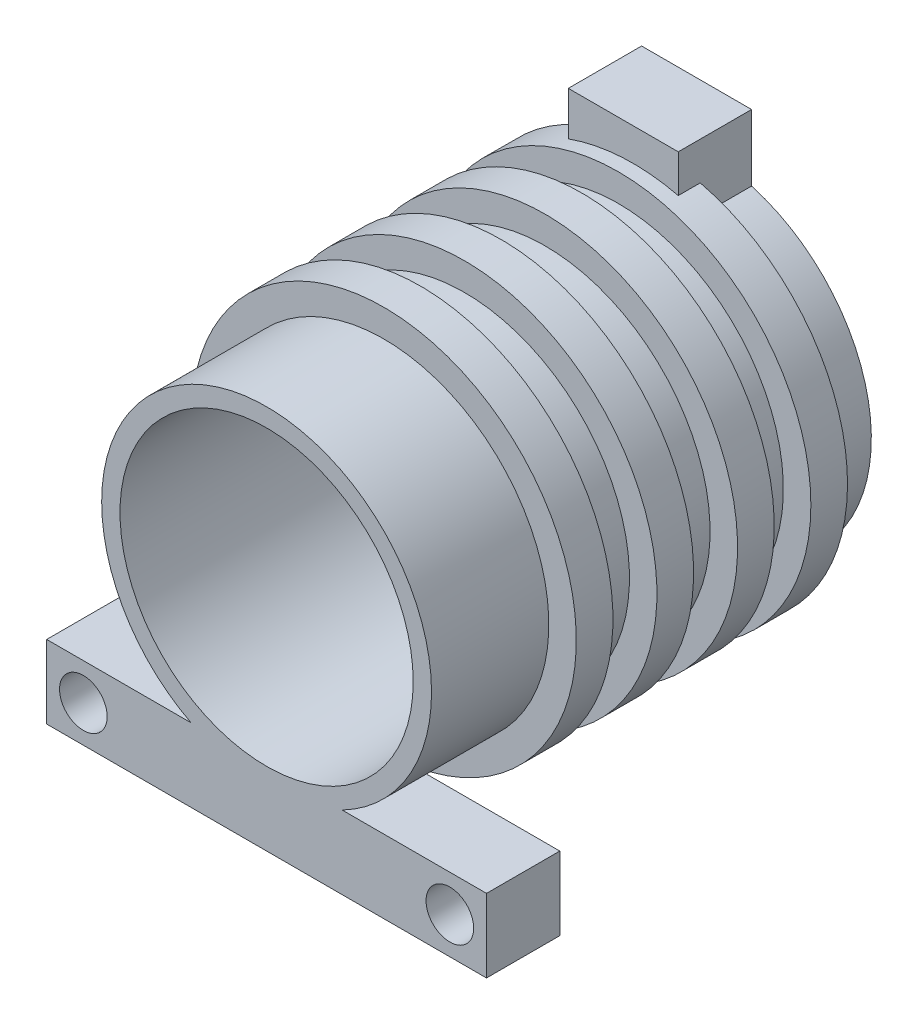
from build123d import *

# Parameters (mm, degrees)
SKETCH2_R           = 57.15
BOSS_EXTRUDE1_DEPTH = 152.4
SKETCH3_R           = 50.8
CUT_EXTRUDE1_DEPTH  = 152.4
SKETCH34_W          = 152.4
SKETCH34_H          = 25.4
BOSS_EXTRUDE3_DEPTH = 25.4
SKETCH35_R          = 8.255
CUT_EXTRUDE2_DEPTH  = 30.48
BOSS_EXTRUDE4_START = -99.06
SKETCH37_R          = 66.675
SKETCH37_R_2        = 57.15
BOSS_EXTRUDE4_DEPTH = 12.7
BOSS_EXTRUDE5_START = -71.12
SKETCH38_R          = 66.675
SKETCH38_R_2        = 57.15
BOSS_EXTRUDE5_DEPTH = 12.7
BOSS_EXTRUDE6_START = -43.18
SKETCH39_R          = 66.675
SKETCH39_R_2        = 57.15
BOSS_EXTRUDE6_DEPTH = 12.7
BOSS_EXTRUDE7_START = -17.78
SKETCH40_R          = 66.675
SKETCH40_R_2        = 57.15
BOSS_EXTRUDE7_DEPTH = 12.7
BOSS_EXTRUDE2_DEPTH = 25.4


with BuildPart() as part:
    # Sketch2 → Boss-Extrude1 (new body)
    with BuildSketch(Plane.XY):
        with Locations(Location((0, 0, 0), (0, 0, 180))):
            Circle(SKETCH2_R)
    extrude(amount=BOSS_EXTRUDE1_DEPTH)

    # Sketch3 → Cut-Extrude1 (cut)
    with BuildSketch(Plane.XY.offset(152.4)):
        Circle(SKETCH3_R)
    extrude(amount=-CUT_EXTRUDE1_DEPTH, mode=Mode.SUBTRACT)

    # Sketch34 → Boss-Extrude3 (add)
    with BuildSketch(Plane.XY.offset(152.4)):
        with Locations((0, -63.5)):
            Rectangle(SKETCH34_W, SKETCH34_H)
    extrude(amount=-BOSS_EXTRUDE3_DEPTH)

    # Sketch35 → Cut-Extrude2 (cut)
    with BuildSketch(Plane.XY.offset(152.4)):
        with Locations((-63.5, -63.5)):
            Circle(SKETCH35_R)
        with Locations((63.5, -63.5)):
            Circle(SKETCH35_R)
    extrude(amount=-CUT_EXTRUDE2_DEPTH, mode=Mode.SUBTRACT)

    # Sketch37 → Boss-Extrude4 (add)
    with BuildSketch(Plane(origin=(0, 0, 0), x_dir=(-1, 0, 0), z_dir=(0, 0, -1)).offset(BOSS_EXTRUDE4_START)):
        Circle(SKETCH37_R)
        Circle(SKETCH37_R_2, mode=Mode.SUBTRACT)
    extrude(amount=-BOSS_EXTRUDE4_DEPTH)

    # Sketch38 → Boss-Extrude5 (add)
    with BuildSketch(Plane(origin=(0, 0, 0), x_dir=(-1, 0, 0), z_dir=(0, 0, -1)).offset(BOSS_EXTRUDE5_START)):
        Circle(SKETCH38_R)
        Circle(SKETCH38_R_2, mode=Mode.SUBTRACT)
    extrude(amount=-BOSS_EXTRUDE5_DEPTH)

    # Sketch39 → Boss-Extrude6 (add)
    with BuildSketch(Plane(origin=(0, 0, 0), x_dir=(-1, 0, 0), z_dir=(0, 0, -1)).offset(BOSS_EXTRUDE6_START)):
        Circle(SKETCH39_R)
        Circle(SKETCH39_R_2, mode=Mode.SUBTRACT)
    extrude(amount=-BOSS_EXTRUDE6_DEPTH)

    # Sketch40 → Boss-Extrude7 (add)
    with BuildSketch(Plane(origin=(0, 0, 0), x_dir=(-1, 0, 0), z_dir=(0, 0, -1)).offset(BOSS_EXTRUDE7_START)):
        Circle(SKETCH40_R)
        Circle(SKETCH40_R_2, mode=Mode.SUBTRACT)
    extrude(amount=-BOSS_EXTRUDE7_DEPTH)

    # Sketch4 → Boss-Extrude2 (add)
    with BuildSketch(Plane(origin=(0, 0, 0), x_dir=(-1, 0, 0), z_dir=(0, 0, -1))):
        with BuildLine():
            Line((-15.645314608, 54.966777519), (-15.645314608, 77.953873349))
            Line((-15.645314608, 77.953873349), (22.454685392, 77.953873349))
            Line((22.454685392, 77.953873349), (22.454685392, 52.553873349))
            ThreePointArc((22.454685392, 52.553873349), (3.612119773, 57.035735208), (-15.645314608, 54.966777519))
        make_face()
    extrude(amount=-BOSS_EXTRUDE2_DEPTH)


solid = part.part
